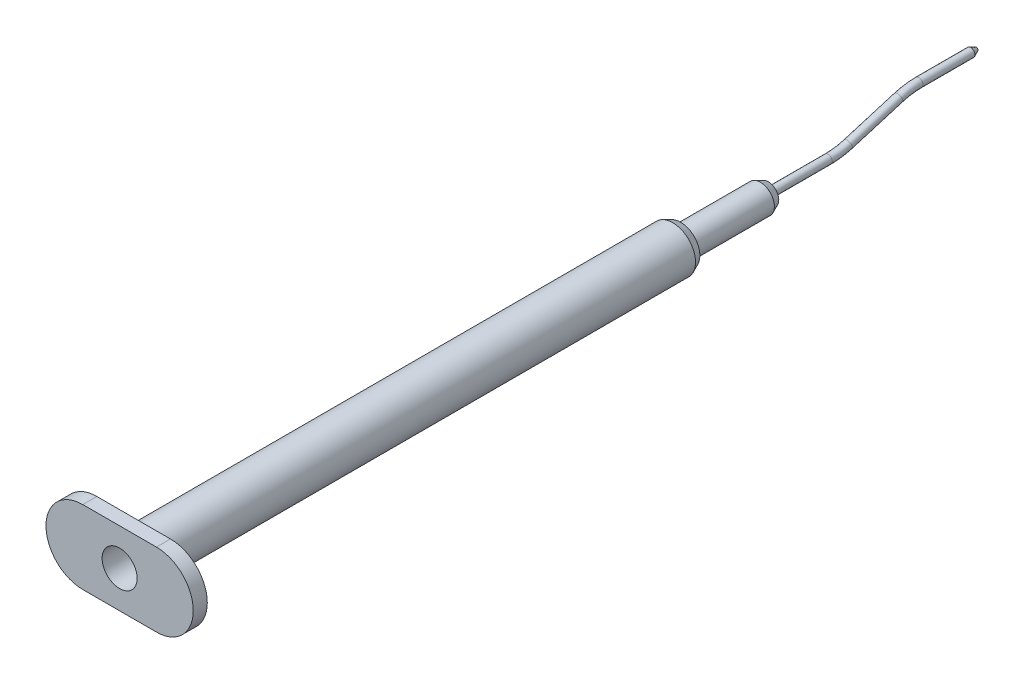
ISO-10303-21;
HEADER;
FILE_DESCRIPTION(('STEP AP214'),'2;1');
FILE_NAME('part.step','',(''),(''),'','','');
FILE_SCHEMA(('AUTOMOTIVE_DESIGN { 1 0 10303 214 1 1 1 1 }'));
ENDSEC;
DATA;
#1=APPLICATION_CONTEXT('core data for automotive mechanical design processes');
#2=APPLICATION_PROTOCOL_DEFINITION('international standard','automotive_design',2000,#1);
#3=PRODUCT_CONTEXT('',#1,'mechanical');
#4=PRODUCT('Part','Part','',(#3));
#5=PRODUCT_RELATED_PRODUCT_CATEGORY('part','',(#4));
#6=PRODUCT_DEFINITION_FORMATION('','',#4);
#7=PRODUCT_DEFINITION_CONTEXT('part definition',#1,'design');
#8=PRODUCT_DEFINITION('design','',#6,#7);
#9=PRODUCT_DEFINITION_SHAPE('','',#8);
#10=(LENGTH_UNIT() NAMED_UNIT(*) SI_UNIT(.MILLI.,.METRE.));
#11=(NAMED_UNIT(*) PLANE_ANGLE_UNIT() SI_UNIT($,.RADIAN.));
#12=(NAMED_UNIT(*) SI_UNIT($,.STERADIAN.) SOLID_ANGLE_UNIT());
#13=UNCERTAINTY_MEASURE_WITH_UNIT(LENGTH_MEASURE(1.E-05),#10,'distance_accuracy_value','');
#14=(GEOMETRIC_REPRESENTATION_CONTEXT(3) GLOBAL_UNCERTAINTY_ASSIGNED_CONTEXT((#13)) GLOBAL_UNIT_ASSIGNED_CONTEXT((#10,
#11,#12)) REPRESENTATION_CONTEXT('',''));
#15=CARTESIAN_POINT('',(0.,0.,0.));
#16=DIRECTION('',(0.,0.,1.));
#17=DIRECTION('',(1.,0.,0.));
#18=AXIS2_PLACEMENT_3D('',#15,#16,#17);
#19=CARTESIAN_POINT('',(0.,0.0360270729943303,-99.0323116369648));
#20=DIRECTION('',(0.,0.,1.));
#21=DIRECTION('',(1.,0.,0.));
#22=AXIS2_PLACEMENT_3D('',#19,#20,#21);
#23=CYLINDRICAL_SURFACE('',#22,0.6);
#24=CARTESIAN_POINT('',(0.,0.0360270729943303,-99.0323116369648));
#25=DIRECTION('',(0.,0.,1.));
#26=DIRECTION('',(1.,0.,0.));
#27=AXIS2_PLACEMENT_3D('',#24,#25,#26);
#28=CIRCLE('',#27,0.6);
#29=CARTESIAN_POINT('',(0.,-0.563972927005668,-99.0323116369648));
#30=VERTEX_POINT('',#29);
#31=EDGE_CURVE('E63',#30,#30,#28,.T.);
#32=ORIENTED_EDGE('',*,*,#31,.T.);
#33=EDGE_LOOP('',(#32));
#34=FACE_BOUND('',#33,.T.);
#35=CARTESIAN_POINT('',(1.04744440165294E-13,0.036027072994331,-90.5));
#36=DIRECTION('',(0.,0.,1.));
#37=DIRECTION('',(1.,0.,0.));
#38=AXIS2_PLACEMENT_3D('',#35,#36,#37);
#39=CIRCLE('',#38,0.6);
#40=CARTESIAN_POINT('',(0.600000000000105,0.036027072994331,-90.5));
#41=VERTEX_POINT('',#40);
#42=EDGE_CURVE('E54',#41,#41,#39,.T.);
#43=ORIENTED_EDGE('',*,*,#42,.F.);
#44=EDGE_LOOP('',(#43));
#45=FACE_BOUND('',#44,.T.);
#46=ADVANCED_FACE('F43',(#34,#45),#23,.T.);
#47=CARTESIAN_POINT('',(0.,0.0360270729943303,-99.0323116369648));
#48=DIRECTION('',(0.,0.,1.));
#49=DIRECTION('',(1.,0.,0.));
#50=AXIS2_PLACEMENT_3D('',#47,#48,#49);
#51=CYLINDRICAL_SURFACE('',#50,0.25);
#52=CARTESIAN_POINT('',(0.,0.0360270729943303,-99.0323116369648));
#53=DIRECTION('',(0.,0.,1.));
#54=DIRECTION('',(1.,0.,0.));
#55=AXIS2_PLACEMENT_3D('',#52,#53,#54);
#56=CIRCLE('',#55,0.25);
#57=CARTESIAN_POINT('',(0.,-0.213972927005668,-99.0323116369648));
#58=VERTEX_POINT('',#57);
#59=EDGE_CURVE('E66',#58,#58,#56,.T.);
#60=ORIENTED_EDGE('',*,*,#59,.F.);
#61=EDGE_LOOP('',(#60));
#62=FACE_BOUND('',#61,.T.);
#63=CARTESIAN_POINT('',(1.04744440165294E-13,0.036027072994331,-90.5));
#64=DIRECTION('',(0.,0.,1.));
#65=DIRECTION('',(1.,0.,0.));
#66=AXIS2_PLACEMENT_3D('',#63,#64,#65);
#67=CIRCLE('',#66,0.25);
#68=CARTESIAN_POINT('',(0.250000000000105,0.036027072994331,-90.5));
#69=VERTEX_POINT('',#68);
#70=EDGE_CURVE('E58',#69,#69,#67,.T.);
#71=ORIENTED_EDGE('',*,*,#70,.T.);
#72=EDGE_LOOP('',(#71));
#73=FACE_BOUND('',#72,.T.);
#74=ADVANCED_FACE('F111',(#62,#73),#51,.F.);
#75=CARTESIAN_POINT('',(0.,10.,-99.0323116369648));
#76=DIRECTION('',(-1.,0.,0.));
#77=DIRECTION('',(0.,0.,1.));
#78=AXIS2_PLACEMENT_3D('',#75,#76,#77);
#79=TOROIDAL_SURFACE('',#78,9.96397292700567,0.6);
#80=CARTESIAN_POINT('',(0.,0.45624482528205,-101.89543818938));
#81=DIRECTION('',(0.,-0.287347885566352,0.957826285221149));
#82=DIRECTION('',(1.,0.,0.));
#83=AXIS2_PLACEMENT_3D('',#80,#81,#82);
#84=CIRCLE('',#83,0.6);
#85=CARTESIAN_POINT('',(0.,-0.118450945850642,-102.06784692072));
#86=VERTEX_POINT('',#85);
#87=EDGE_CURVE('E69',#86,#86,#84,.T.);
#88=CARTESIAN_POINT('',(0.,10.,-99.0323116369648));
#89=DIRECTION('',(-1.,0.,0.));
#90=DIRECTION('',(0.,0.,1.));
#91=AXIS2_PLACEMENT_3D('',#88,#89,#90);
#92=CIRCLE('',#91,10.5639729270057);
#93=EDGE_CURVE('',#86,#30,#92,.T.);
#94=ORIENTED_EDGE('',*,*,#87,.T.);
#95=ORIENTED_EDGE('',*,*,#31,.F.);
#96=ORIENTED_EDGE('',*,*,#93,.T.);
#97=ORIENTED_EDGE('',*,*,#93,.F.);
#98=EDGE_LOOP('',(#94,#96,#95,#97));
#99=FACE_BOUND('',#98,.T.);
#100=ADVANCED_FACE('F107',(#99),#79,.T.);
#101=CARTESIAN_POINT('',(0.,10.,-99.0323116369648));
#102=DIRECTION('',(-1.,0.,0.));
#103=DIRECTION('',(0.,0.,1.));
#104=AXIS2_PLACEMENT_3D('',#101,#102,#103);
#105=TOROIDAL_SURFACE('',#104,9.96397292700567,0.25);
#106=CARTESIAN_POINT('',(0.,0.45624482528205,-101.89543818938));
#107=DIRECTION('',(0.,-0.287347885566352,0.957826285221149));
#108=DIRECTION('',(1.,0.,0.));
#109=AXIS2_PLACEMENT_3D('',#106,#107,#108);
#110=CIRCLE('',#109,0.25);
#111=CARTESIAN_POINT('',(0.,0.21678825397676,-101.967275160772));
#112=VERTEX_POINT('',#111);
#113=EDGE_CURVE('E72',#112,#112,#110,.T.);
#114=CARTESIAN_POINT('',(0.,10.,-99.0323116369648));
#115=DIRECTION('',(-1.,0.,0.));
#116=DIRECTION('',(0.,0.,1.));
#117=AXIS2_PLACEMENT_3D('',#114,#115,#116);
#118=CIRCLE('',#117,10.2139729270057);
#119=EDGE_CURVE('',#112,#58,#118,.T.);
#120=ORIENTED_EDGE('',*,*,#113,.F.);
#121=ORIENTED_EDGE('',*,*,#59,.T.);
#122=ORIENTED_EDGE('',*,*,#119,.T.);
#123=ORIENTED_EDGE('',*,*,#119,.F.);
#124=EDGE_LOOP('',(#120,#122,#121,#123));
#125=FACE_BOUND('',#124,.T.);
#126=ADVANCED_FACE('F104',(#125),#105,.F.);
#127=CARTESIAN_POINT('',(0.,2.61277052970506,-109.083857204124));
#128=DIRECTION('',(0.,-0.287347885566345,0.957826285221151));
#129=DIRECTION('',(0.,-0.957826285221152,-0.287347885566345));
#130=AXIS2_PLACEMENT_3D('',#127,#128,#129);
#131=CYLINDRICAL_SURFACE('',#130,0.6);
#132=CARTESIAN_POINT('',(0.,2.61277052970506,-109.083857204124));
#133=DIRECTION('',(0.,-0.287347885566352,0.957826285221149));
#134=DIRECTION('',(1.,0.,0.));
#135=AXIS2_PLACEMENT_3D('',#132,#133,#134);
#136=CIRCLE('',#135,0.6);
#137=CARTESIAN_POINT('',(0.,3.18746630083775,-108.911448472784));
#138=VERTEX_POINT('',#137);
#139=EDGE_CURVE('E75',#138,#138,#136,.T.);
#140=ORIENTED_EDGE('',*,*,#139,.T.);
#141=EDGE_LOOP('',(#140));
#142=FACE_BOUND('',#141,.T.);
#143=ORIENTED_EDGE('',*,*,#87,.F.);
#144=EDGE_LOOP('',(#143));
#145=FACE_BOUND('',#144,.T.);
#146=ADVANCED_FACE('F100',(#142,#145),#131,.T.);
#147=CARTESIAN_POINT('',(0.,2.61277052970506,-109.083857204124));
#148=DIRECTION('',(0.,-0.287347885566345,0.957826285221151));
#149=DIRECTION('',(0.,-0.957826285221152,-0.287347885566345));
#150=AXIS2_PLACEMENT_3D('',#147,#148,#149);
#151=CYLINDRICAL_SURFACE('',#150,0.25);
#152=CARTESIAN_POINT('',(0.,2.61277052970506,-109.083857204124));
#153=DIRECTION('',(0.,-0.287347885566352,0.957826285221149));
#154=DIRECTION('',(1.,0.,0.));
#155=AXIS2_PLACEMENT_3D('',#152,#153,#154);
#156=CIRCLE('',#155,0.25);
#157=CARTESIAN_POINT('',(0.,2.85222710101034,-109.012020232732));
#158=VERTEX_POINT('',#157);
#159=EDGE_CURVE('E78',#158,#158,#156,.T.);
#160=ORIENTED_EDGE('',*,*,#159,.F.);
#161=EDGE_LOOP('',(#160));
#162=FACE_BOUND('',#161,.T.);
#163=ORIENTED_EDGE('',*,*,#113,.T.);
#164=EDGE_LOOP('',(#163));
#165=FACE_BOUND('',#164,.T.);
#166=ADVANCED_FACE('F97',(#162,#165),#151,.F.);
#167=CARTESIAN_POINT('',(0.,-7.,-111.967688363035));
#168=DIRECTION('',(1.,0.,0.));
#169=DIRECTION('',(0.,0.,-1.));
#170=AXIS2_PLACEMENT_3D('',#167,#168,#169);
#171=TOROIDAL_SURFACE('',#170,10.0360270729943,0.6);
#172=CARTESIAN_POINT('',(0.,3.03602707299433,-111.967688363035));
#173=DIRECTION('',(0.,0.,1.));
#174=DIRECTION('',(1.,0.,0.));
#175=AXIS2_PLACEMENT_3D('',#172,#173,#174);
#176=CIRCLE('',#175,0.6);
#177=CARTESIAN_POINT('',(0.,3.63602707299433,-111.967688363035));
#178=VERTEX_POINT('',#177);
#179=EDGE_CURVE('E81',#178,#178,#176,.T.);
#180=CARTESIAN_POINT('',(0.,-7.,-111.967688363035));
#181=DIRECTION('',(1.,0.,0.));
#182=DIRECTION('',(0.,0.,-1.));
#183=AXIS2_PLACEMENT_3D('',#180,#181,#182);
#184=CIRCLE('',#183,10.6360270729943);
#185=EDGE_CURVE('',#178,#138,#184,.T.);
#186=ORIENTED_EDGE('',*,*,#179,.T.);
#187=ORIENTED_EDGE('',*,*,#139,.F.);
#188=ORIENTED_EDGE('',*,*,#185,.T.);
#189=ORIENTED_EDGE('',*,*,#185,.F.);
#190=EDGE_LOOP('',(#186,#188,#187,#189));
#191=FACE_BOUND('',#190,.T.);
#192=ADVANCED_FACE('F93',(#191),#171,.T.);
#193=CARTESIAN_POINT('',(0.,-7.,-111.967688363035));
#194=DIRECTION('',(1.,0.,0.));
#195=DIRECTION('',(0.,0.,-1.));
#196=AXIS2_PLACEMENT_3D('',#193,#194,#195);
#197=TOROIDAL_SURFACE('',#196,10.0360270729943,0.25);
#198=CARTESIAN_POINT('',(0.,3.03602707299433,-111.967688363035));
#199=DIRECTION('',(0.,0.,1.));
#200=DIRECTION('',(1.,0.,0.));
#201=AXIS2_PLACEMENT_3D('',#198,#199,#200);
#202=CIRCLE('',#201,0.25);
#203=CARTESIAN_POINT('',(0.,3.28602707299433,-111.967688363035));
#204=VERTEX_POINT('',#203);
#205=EDGE_CURVE('E84',#204,#204,#202,.T.);
#206=CARTESIAN_POINT('',(0.,-7.,-111.967688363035));
#207=DIRECTION('',(1.,0.,0.));
#208=DIRECTION('',(0.,0.,-1.));
#209=AXIS2_PLACEMENT_3D('',#206,#207,#208);
#210=CIRCLE('',#209,10.2860270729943);
#211=EDGE_CURVE('',#204,#158,#210,.T.);
#212=ORIENTED_EDGE('',*,*,#205,.F.);
#213=ORIENTED_EDGE('',*,*,#159,.T.);
#214=ORIENTED_EDGE('',*,*,#211,.T.);
#215=ORIENTED_EDGE('',*,*,#211,.F.);
#216=EDGE_LOOP('',(#212,#214,#213,#215));
#217=FACE_BOUND('',#216,.T.);
#218=ADVANCED_FACE('F90',(#217),#197,.F.);
#219=CARTESIAN_POINT('',(0.,3.03602707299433,-111.967688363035));
#220=DIRECTION('',(0.,0.,-1.));
#221=DIRECTION('',(-1.,0.,0.));
#222=AXIS2_PLACEMENT_3D('',#219,#220,#221);
#223=CYLINDRICAL_SURFACE('',#222,0.25);
#224=CARTESIAN_POINT('',(0.,3.03602707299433,-120.163094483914));
#225=DIRECTION('',(0.,0.,1.));
#226=DIRECTION('',(1.,0.,0.));
#227=AXIS2_PLACEMENT_3D('',#224,#225,#226);
#228=CIRCLE('',#227,0.25);
#229=CARTESIAN_POINT('',(0.250000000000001,3.03602707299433,-120.163094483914));
#230=VERTEX_POINT('',#229);
#231=EDGE_CURVE('E11',#230,#230,#228,.F.);
#232=ORIENTED_EDGE('',*,*,#231,.T.);
#233=EDGE_LOOP('',(#232));
#234=FACE_BOUND('',#233,.T.);
#235=ORIENTED_EDGE('',*,*,#205,.T.);
#236=EDGE_LOOP('',(#235));
#237=FACE_BOUND('',#236,.T.);
#238=ADVANCED_FACE('F88',(#234,#237),#223,.F.);
#239=CARTESIAN_POINT('',(0.,3.03602707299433,-111.967688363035));
#240=DIRECTION('',(0.,0.,-1.));
#241=DIRECTION('',(-1.,0.,0.));
#242=AXIS2_PLACEMENT_3D('',#239,#240,#241);
#243=CYLINDRICAL_SURFACE('',#242,0.6);
#244=CARTESIAN_POINT('',(0.,3.03602707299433,-119.376981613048));
#245=DIRECTION('',(0.,0.,1.));
#246=DIRECTION('',(1.,0.,0.));
#247=AXIS2_PLACEMENT_3D('',#244,#245,#246);
#248=CIRCLE('',#247,0.6);
#249=CARTESIAN_POINT('',(0.600000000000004,3.03602707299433,-119.376981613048));
#250=VERTEX_POINT('',#249);
#251=EDGE_CURVE('E50',#250,#250,#248,.T.);
#252=ORIENTED_EDGE('',*,*,#251,.T.);
#253=EDGE_LOOP('',(#252));
#254=FACE_BOUND('',#253,.T.);
#255=ORIENTED_EDGE('',*,*,#179,.F.);
#256=EDGE_LOOP('',(#255));
#257=FACE_BOUND('',#256,.T.);
#258=ADVANCED_FACE('F120',(#254,#257),#243,.T.);
#259=CARTESIAN_POINT('',(1.04744440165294E-13,0.036027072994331,-90.5));
#260=DIRECTION('',(0.,0.,1.));
#261=DIRECTION('',(1.,0.,0.));
#262=AXIS2_PLACEMENT_3D('',#259,#260,#261);
#263=PLANE('',#262);
#264=ORIENTED_EDGE('',*,*,#70,.F.);
#265=EDGE_LOOP('',(#264));
#266=FACE_BOUND('',#265,.T.);
#267=ORIENTED_EDGE('',*,*,#42,.T.);
#268=EDGE_LOOP('',(#267));
#269=FACE_BOUND('',#268,.T.);
#270=ADVANCED_FACE('F117',(#266,#269),#263,.T.);
#271=CARTESIAN_POINT('',(0.,3.03602707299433,-119.376981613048));
#272=DIRECTION('',(0.,0.,1.));
#273=DIRECTION('',(1.,0.,0.));
#274=AXIS2_PLACEMENT_3D('',#271,#272,#273);
#275=CONICAL_SURFACE('',#274,0.6,0.418879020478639);
#276=ORIENTED_EDGE('',*,*,#231,.F.);
#277=EDGE_LOOP('',(#276));
#278=FACE_BOUND('',#277,.T.);
#279=ORIENTED_EDGE('',*,*,#251,.F.);
#280=EDGE_LOOP('',(#279));
#281=FACE_BOUND('',#280,.T.);
#282=ADVANCED_FACE('F45',(#278,#281),#275,.T.);
#283=CLOSED_SHELL('',(#46,#74,#100,#126,#146,#166,#192,#218,#238,#258,#270,#282));
#284=MANIFOLD_SOLID_BREP('B2',#283);
#285=CARTESIAN_POINT('',(0.,0.,-75.));
#286=DIRECTION('',(0.,0.,1.));
#287=DIRECTION('',(1.,0.,0.));
#288=AXIS2_PLACEMENT_3D('',#285,#286,#287);
#289=CYLINDRICAL_SURFACE('',#288,3.25);
#290=CARTESIAN_POINT('',(0.,0.,-76.8769816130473));
#291=DIRECTION('',(0.,0.,-1.));
#292=DIRECTION('',(-1.,0.,0.));
#293=AXIS2_PLACEMENT_3D('',#290,#291,#292);
#294=CIRCLE('',#293,3.25);
#295=CARTESIAN_POINT('',(-3.25,0.,-76.8769816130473));
#296=VERTEX_POINT('',#295);
#297=EDGE_CURVE('E234',#296,#296,#294,.F.);
#298=ORIENTED_EDGE('',*,*,#297,.T.);
#299=EDGE_LOOP('',(#298));
#300=FACE_BOUND('',#299,.T.);
#301=CARTESIAN_POINT('',(0.,0.,0.));
#302=DIRECTION('',(0.,0.,1.));
#303=DIRECTION('',(1.,0.,0.));
#304=AXIS2_PLACEMENT_3D('',#301,#302,#303);
#305=CIRCLE('',#304,3.25);
#306=CARTESIAN_POINT('',(3.25,0.,0.));
#307=VERTEX_POINT('',#306);
#308=EDGE_CURVE('E306',#307,#307,#305,.T.);
#309=ORIENTED_EDGE('',*,*,#308,.F.);
#310=EDGE_LOOP('',(#309));
#311=FACE_BOUND('',#310,.T.);
#312=ADVANCED_FACE('F225',(#300,#311),#289,.T.);
#313=CARTESIAN_POINT('',(0.,0.,-75.));
#314=DIRECTION('',(0.,0.,1.));
#315=DIRECTION('',(1.,0.,0.));
#316=AXIS2_PLACEMENT_3D('',#313,#314,#315);
#317=CYLINDRICAL_SURFACE('',#316,2.5);
#318=CARTESIAN_POINT('',(0.,0.,2.));
#319=DIRECTION('',(0.,0.,1.));
#320=DIRECTION('',(1.,0.,0.));
#321=AXIS2_PLACEMENT_3D('',#318,#319,#320);
#322=CIRCLE('',#321,2.5);
#323=CARTESIAN_POINT('',(2.5,0.,2.));
#324=VERTEX_POINT('',#323);
#325=EDGE_CURVE('E296',#324,#324,#322,.T.);
#326=ORIENTED_EDGE('',*,*,#325,.T.);
#327=EDGE_LOOP('',(#326));
#328=FACE_BOUND('',#327,.T.);
#329=CARTESIAN_POINT('',(0.,0.,-75.));
#330=DIRECTION('',(0.,0.,1.));
#331=DIRECTION('',(1.,0.,0.));
#332=AXIS2_PLACEMENT_3D('',#329,#330,#331);
#333=CIRCLE('',#332,2.5);
#334=CARTESIAN_POINT('',(2.5,0.,-75.));
#335=VERTEX_POINT('',#334);
#336=EDGE_CURVE('E303',#335,#335,#333,.T.);
#337=ORIENTED_EDGE('',*,*,#336,.F.);
#338=EDGE_LOOP('',(#337));
#339=FACE_BOUND('',#338,.T.);
#340=ADVANCED_FACE('F329',(#328,#339),#317,.F.);
#341=CARTESIAN_POINT('',(-5.25,0.,2.));
#342=DIRECTION('',(0.,0.,-1.));
#343=DIRECTION('',(-1.,0.,0.));
#344=AXIS2_PLACEMENT_3D('',#341,#342,#343);
#345=CYLINDRICAL_SURFACE('',#344,5.25);
#346=CARTESIAN_POINT('',(-5.25,0.,0.));
#347=DIRECTION('',(0.,0.,1.));
#348=DIRECTION('',(1.,0.,0.));
#349=AXIS2_PLACEMENT_3D('',#346,#347,#348);
#350=CIRCLE('',#349,5.25);
#351=CARTESIAN_POINT('',(-5.25,5.25,0.));
#352=VERTEX_POINT('',#351);
#353=CARTESIAN_POINT('',(-5.25,-5.25,0.));
#354=VERTEX_POINT('',#353);
#355=EDGE_CURVE('E293',#352,#354,#350,.T.);
#356=ORIENTED_EDGE('',*,*,#355,.T.);
#357=DIRECTION('',(0.,0.,-1.));
#358=VECTOR('',#357,1.);
#359=CARTESIAN_POINT('',(-5.25,-5.25,2.));
#360=LINE('',#359,#358);
#361=CARTESIAN_POINT('',(-5.25,-5.25,2.));
#362=VERTEX_POINT('',#361);
#363=EDGE_CURVE('E284',#362,#354,#360,.T.);
#364=ORIENTED_EDGE('',*,*,#363,.F.);
#365=CARTESIAN_POINT('',(-5.25,0.,2.));
#366=DIRECTION('',(0.,0.,1.));
#367=DIRECTION('',(1.,0.,0.));
#368=AXIS2_PLACEMENT_3D('',#365,#366,#367);
#369=CIRCLE('',#368,5.25);
#370=CARTESIAN_POINT('',(-5.25,5.25,2.));
#371=VERTEX_POINT('',#370);
#372=EDGE_CURVE('E278',#371,#362,#369,.T.);
#373=ORIENTED_EDGE('',*,*,#372,.F.);
#374=DIRECTION('',(0.,0.,-1.));
#375=VECTOR('',#374,1.);
#376=CARTESIAN_POINT('',(-5.25,5.25,2.));
#377=LINE('',#376,#375);
#378=EDGE_CURVE('E289',#371,#352,#377,.T.);
#379=ORIENTED_EDGE('',*,*,#378,.T.);
#380=EDGE_LOOP('',(#356,#364,#373,#379));
#381=FACE_BOUND('',#380,.T.);
#382=ADVANCED_FACE('F334',(#381),#345,.T.);
#383=CARTESIAN_POINT('',(-5.25,-5.25,2.));
#384=DIRECTION('',(0.,1.,0.));
#385=DIRECTION('',(0.,0.,1.));
#386=AXIS2_PLACEMENT_3D('',#383,#384,#385);
#387=PLANE('',#386);
#388=DIRECTION('',(1.,0.,0.));
#389=VECTOR('',#388,1.);
#390=CARTESIAN_POINT('',(-5.25,-5.25,0.));
#391=LINE('',#390,#389);
#392=CARTESIAN_POINT('',(5.25,-5.25,0.));
#393=VERTEX_POINT('',#392);
#394=EDGE_CURVE('E283',#354,#393,#391,.T.);
#395=ORIENTED_EDGE('',*,*,#394,.T.);
#396=DIRECTION('',(0.,0.,-1.));
#397=VECTOR('',#396,1.);
#398=CARTESIAN_POINT('',(5.25,-5.25,2.));
#399=LINE('',#398,#397);
#400=CARTESIAN_POINT('',(5.25,-5.25,2.));
#401=VERTEX_POINT('',#400);
#402=EDGE_CURVE('E281',#401,#393,#399,.T.);
#403=ORIENTED_EDGE('',*,*,#402,.F.);
#404=DIRECTION('',(1.,0.,0.));
#405=VECTOR('',#404,1.);
#406=CARTESIAN_POINT('',(-5.25,-5.25,2.));
#407=LINE('',#406,#405);
#408=EDGE_CURVE('E273',#362,#401,#407,.T.);
#409=ORIENTED_EDGE('',*,*,#408,.F.);
#410=ORIENTED_EDGE('',*,*,#363,.T.);
#411=EDGE_LOOP('',(#395,#403,#409,#410));
#412=FACE_BOUND('',#411,.T.);
#413=ADVANCED_FACE('F282',(#412),#387,.F.);
#414=CARTESIAN_POINT('',(5.25,0.,2.));
#415=DIRECTION('',(0.,0.,-1.));
#416=DIRECTION('',(-1.,0.,0.));
#417=AXIS2_PLACEMENT_3D('',#414,#415,#416);
#418=CYLINDRICAL_SURFACE('',#417,5.25);
#419=CARTESIAN_POINT('',(5.25,0.,0.));
#420=DIRECTION('',(0.,0.,1.));
#421=DIRECTION('',(1.,0.,0.));
#422=AXIS2_PLACEMENT_3D('',#419,#420,#421);
#423=CIRCLE('',#422,5.25);
#424=CARTESIAN_POINT('',(5.25,5.25,0.));
#425=VERTEX_POINT('',#424);
#426=EDGE_CURVE('E259',#393,#425,#423,.T.);
#427=ORIENTED_EDGE('',*,*,#426,.T.);
#428=DIRECTION('',(0.,0.,-1.));
#429=VECTOR('',#428,1.);
#430=CARTESIAN_POINT('',(5.25,5.25,2.));
#431=LINE('',#430,#429);
#432=CARTESIAN_POINT('',(5.25,5.25,2.));
#433=VERTEX_POINT('',#432);
#434=EDGE_CURVE('E285',#433,#425,#431,.T.);
#435=ORIENTED_EDGE('',*,*,#434,.F.);
#436=CARTESIAN_POINT('',(5.25,0.,2.));
#437=DIRECTION('',(0.,0.,1.));
#438=DIRECTION('',(1.,0.,0.));
#439=AXIS2_PLACEMENT_3D('',#436,#437,#438);
#440=CIRCLE('',#439,5.25);
#441=EDGE_CURVE('E276',#401,#433,#440,.T.);
#442=ORIENTED_EDGE('',*,*,#441,.F.);
#443=ORIENTED_EDGE('',*,*,#402,.T.);
#444=EDGE_LOOP('',(#427,#435,#442,#443));
#445=FACE_BOUND('',#444,.T.);
#446=ADVANCED_FACE('F287',(#445),#418,.T.);
#447=CARTESIAN_POINT('',(-5.25,5.25,2.));
#448=DIRECTION('',(0.,-1.,0.));
#449=DIRECTION('',(0.,0.,-1.));
#450=AXIS2_PLACEMENT_3D('',#447,#448,#449);
#451=PLANE('',#450);
#452=DIRECTION('',(-1.,0.,0.));
#453=VECTOR('',#452,1.);
#454=CARTESIAN_POINT('',(-5.25,5.25,0.));
#455=LINE('',#454,#453);
#456=EDGE_CURVE('E265',#425,#352,#455,.T.);
#457=ORIENTED_EDGE('',*,*,#456,.T.);
#458=ORIENTED_EDGE('',*,*,#378,.F.);
#459=DIRECTION('',(-1.,0.,0.));
#460=VECTOR('',#459,1.);
#461=CARTESIAN_POINT('',(-5.25,5.25,2.));
#462=LINE('',#461,#460);
#463=EDGE_CURVE('E242',#433,#371,#462,.T.);
#464=ORIENTED_EDGE('',*,*,#463,.F.);
#465=ORIENTED_EDGE('',*,*,#434,.T.);
#466=EDGE_LOOP('',(#457,#458,#464,#465));
#467=FACE_BOUND('',#466,.T.);
#468=ADVANCED_FACE('F345',(#467),#451,.F.);
#469=CARTESIAN_POINT('',(-5.25,0.,2.));
#470=DIRECTION('',(0.,0.,1.));
#471=DIRECTION('',(1.,0.,0.));
#472=AXIS2_PLACEMENT_3D('',#469,#470,#471);
#473=PLANE('',#472);
#474=ORIENTED_EDGE('',*,*,#325,.F.);
#475=EDGE_LOOP('',(#474));
#476=FACE_BOUND('',#475,.T.);
#477=ORIENTED_EDGE('',*,*,#372,.T.);
#478=ORIENTED_EDGE('',*,*,#408,.T.);
#479=ORIENTED_EDGE('',*,*,#441,.T.);
#480=ORIENTED_EDGE('',*,*,#463,.T.);
#481=EDGE_LOOP('',(#477,#478,#479,#480));
#482=FACE_BOUND('',#481,.T.);
#483=ADVANCED_FACE('F274',(#476,#482),#473,.T.);
#484=CARTESIAN_POINT('',(-5.25,0.,0.));
#485=DIRECTION('',(0.,0.,1.));
#486=DIRECTION('',(1.,0.,0.));
#487=AXIS2_PLACEMENT_3D('',#484,#485,#486);
#488=PLANE('',#487);
#489=ORIENTED_EDGE('',*,*,#308,.T.);
#490=EDGE_LOOP('',(#489));
#491=FACE_BOUND('',#490,.T.);
#492=ORIENTED_EDGE('',*,*,#355,.F.);
#493=ORIENTED_EDGE('',*,*,#456,.F.);
#494=ORIENTED_EDGE('',*,*,#426,.F.);
#495=ORIENTED_EDGE('',*,*,#394,.F.);
#496=EDGE_LOOP('',(#492,#493,#494,#495));
#497=FACE_BOUND('',#496,.T.);
#498=ADVANCED_FACE('F348',(#491,#497),#488,.F.);
#499=CARTESIAN_POINT('',(-2.61861100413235E-13,0.,-75.));
#500=DIRECTION('',(0.,0.,1.));
#501=DIRECTION('',(1.,0.,0.));
#502=AXIS2_PLACEMENT_3D('',#499,#500,#501);
#503=PLANE('',#502);
#504=CARTESIAN_POINT('',(-2.61861100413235E-13,0.,-75.));
#505=DIRECTION('',(0.,0.,1.));
#506=DIRECTION('',(1.,0.,0.));
#507=AXIS2_PLACEMENT_3D('',#504,#505,#506);
#508=CIRCLE('',#507,1.);
#509=CARTESIAN_POINT('',(-1.00000000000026,0.,-75.));
#510=VERTEX_POINT('',#509);
#511=EDGE_CURVE('E378',#510,#510,#508,.T.);
#512=ORIENTED_EDGE('',*,*,#511,.F.);
#513=EDGE_LOOP('',(#512));
#514=FACE_BOUND('',#513,.T.);
#515=ORIENTED_EDGE('',*,*,#336,.T.);
#516=EDGE_LOOP('',(#515));
#517=FACE_BOUND('',#516,.T.);
#518=ADVANCED_FACE('F351',(#514,#517),#503,.T.);
#519=CARTESIAN_POINT('',(-2.72335544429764E-13,-3.25,-78.));
#520=DIRECTION('',(0.,0.,-1.));
#521=DIRECTION('',(-1.,0.,0.));
#522=AXIS2_PLACEMENT_3D('',#519,#520,#521);
#523=PLANE('',#522);
#524=CARTESIAN_POINT('',(0.,0.,-78.));
#525=DIRECTION('',(0.,0.,-1.));
#526=DIRECTION('',(-1.,0.,0.));
#527=AXIS2_PLACEMENT_3D('',#524,#525,#526);
#528=CIRCLE('',#527,2.74999999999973);
#529=CARTESIAN_POINT('',(-2.74999999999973,0.,-78.));
#530=VERTEX_POINT('',#529);
#531=EDGE_CURVE('E41',#530,#530,#528,.T.);
#532=ORIENTED_EDGE('',*,*,#531,.T.);
#533=EDGE_LOOP('',(#532));
#534=FACE_BOUND('',#533,.T.);
#535=CARTESIAN_POINT('',(-2.72335544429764E-13,0.,-78.));
#536=DIRECTION('',(0.,0.,1.));
#537=DIRECTION('',(1.,0.,0.));
#538=AXIS2_PLACEMENT_3D('',#535,#536,#537);
#539=CIRCLE('',#538,2.);
#540=CARTESIAN_POINT('',(1.99999999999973,0.,-78.));
#541=VERTEX_POINT('',#540);
#542=EDGE_CURVE('E384',#541,#541,#539,.T.);
#543=ORIENTED_EDGE('',*,*,#542,.T.);
#544=EDGE_LOOP('',(#543));
#545=FACE_BOUND('',#544,.T.);
#546=ADVANCED_FACE('F358',(#534,#545),#523,.T.);
#547=CARTESIAN_POINT('',(0.,0.,2.00000000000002));
#548=DIRECTION('',(0.,0.,1.));
#549=DIRECTION('',(1.,0.,0.));
#550=AXIS2_PLACEMENT_3D('',#547,#548,#549);
#551=CYLINDRICAL_SURFACE('',#550,2.);
#552=CARTESIAN_POINT('',(-3.12058063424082E-13,0.,-89.3769816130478));
#553=DIRECTION('',(0.,0.,-1.));
#554=DIRECTION('',(-1.,0.,0.));
#555=AXIS2_PLACEMENT_3D('',#552,#553,#554);
#556=CIRCLE('',#555,2.);
#557=CARTESIAN_POINT('',(1.99999999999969,0.,-89.3769816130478));
#558=VERTEX_POINT('',#557);
#559=EDGE_CURVE('E309',#558,#558,#556,.F.);
#560=ORIENTED_EDGE('',*,*,#559,.T.);
#561=EDGE_LOOP('',(#560));
#562=FACE_BOUND('',#561,.T.);
#563=ORIENTED_EDGE('',*,*,#542,.F.);
#564=EDGE_LOOP('',(#563));
#565=FACE_BOUND('',#564,.T.);
#566=ADVANCED_FACE('F362',(#562,#565),#551,.T.);
#567=CARTESIAN_POINT('',(-3.15979061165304E-13,-2.,-90.5));
#568=DIRECTION('',(0.,0.,-1.));
#569=DIRECTION('',(-1.,0.,0.));
#570=AXIS2_PLACEMENT_3D('',#567,#568,#569);
#571=PLANE('',#570);
#572=CARTESIAN_POINT('',(-3.15979061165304E-13,0.,-90.5));
#573=DIRECTION('',(0.,0.,-1.));
#574=DIRECTION('',(-1.,0.,0.));
#575=AXIS2_PLACEMENT_3D('',#572,#573,#574);
#576=CIRCLE('',#575,1.49999999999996);
#577=CARTESIAN_POINT('',(1.49999999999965,0.,-90.5));
#578=VERTEX_POINT('',#577);
#579=EDGE_CURVE('E312',#578,#578,#576,.T.);
#580=ORIENTED_EDGE('',*,*,#579,.T.);
#581=EDGE_LOOP('',(#580));
#582=FACE_BOUND('',#581,.T.);
#583=CARTESIAN_POINT('',(-3.15979061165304E-13,0.,-90.5));
#584=DIRECTION('',(0.,0.,-1.));
#585=DIRECTION('',(-1.,0.,0.));
#586=AXIS2_PLACEMENT_3D('',#583,#584,#585);
#587=CIRCLE('',#586,1.);
#588=CARTESIAN_POINT('',(-1.00000000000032,0.,-90.5));
#589=VERTEX_POINT('',#588);
#590=EDGE_CURVE('E381',#589,#589,#587,.T.);
#591=ORIENTED_EDGE('',*,*,#590,.F.);
#592=EDGE_LOOP('',(#591));
#593=FACE_BOUND('',#592,.T.);
#594=ADVANCED_FACE('F366',(#582,#593),#571,.T.);
#595=CARTESIAN_POINT('',(0.,0.,2.00000000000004));
#596=DIRECTION('',(0.,0.,-1.));
#597=DIRECTION('',(-1.,0.,0.));
#598=AXIS2_PLACEMENT_3D('',#595,#596,#597);
#599=CYLINDRICAL_SURFACE('',#598,1.);
#600=CARTESIAN_POINT('',(-1.00000000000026,0.,-75.));
#601=CARTESIAN_POINT('',(-1.00000000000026,0.,-75.1614583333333));
#602=CARTESIAN_POINT('',(-1.00000000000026,0.,-75.3229166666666));
#603=CARTESIAN_POINT('',(-1.00000000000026,0.,-75.6458333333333));
#604=CARTESIAN_POINT('',(-1.00000000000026,0.,-75.8072916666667));
#605=CARTESIAN_POINT('',(-1.00000000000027,0.,-76.1302083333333));
#606=CARTESIAN_POINT('',(-1.00000000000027,0.,-76.2916666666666));
#607=CARTESIAN_POINT('',(-1.00000000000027,0.,-76.6145833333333));
#608=CARTESIAN_POINT('',(-1.00000000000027,0.,-76.7760416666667));
#609=CARTESIAN_POINT('',(-1.00000000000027,0.,-77.0989583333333));
#610=CARTESIAN_POINT('',(-1.00000000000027,0.,-77.2604166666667));
#611=CARTESIAN_POINT('',(-1.00000000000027,0.,-77.5833333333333));
#612=CARTESIAN_POINT('',(-1.00000000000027,0.,-77.7447916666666));
#613=CARTESIAN_POINT('',(-1.00000000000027,0.,-78.0677083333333));
#614=CARTESIAN_POINT('',(-1.00000000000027,0.,-78.2291666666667));
#615=CARTESIAN_POINT('',(-1.00000000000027,0.,-78.5520833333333));
#616=CARTESIAN_POINT('',(-1.00000000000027,0.,-78.7135416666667));
#617=CARTESIAN_POINT('',(-1.00000000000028,0.,-79.0364583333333));
#618=CARTESIAN_POINT('',(-1.00000000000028,0.,-79.1979166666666));
#619=CARTESIAN_POINT('',(-1.00000000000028,0.,-79.5208333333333));
#620=CARTESIAN_POINT('',(-1.00000000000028,0.,-79.6822916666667));
#621=CARTESIAN_POINT('',(-1.00000000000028,0.,-80.0052083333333));
#622=CARTESIAN_POINT('',(-1.00000000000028,0.,-80.1666666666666));
#623=CARTESIAN_POINT('',(-1.00000000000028,0.,-80.4895833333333));
#624=CARTESIAN_POINT('',(-1.00000000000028,0.,-80.6510416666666));
#625=CARTESIAN_POINT('',(-1.00000000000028,0.,-80.9739583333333));
#626=CARTESIAN_POINT('',(-1.00000000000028,0.,-81.1354166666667));
#627=CARTESIAN_POINT('',(-1.00000000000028,0.,-81.4583333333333));
#628=CARTESIAN_POINT('',(-1.00000000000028,0.,-81.6197916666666));
#629=CARTESIAN_POINT('',(-1.00000000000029,0.,-81.9427083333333));
#630=CARTESIAN_POINT('',(-1.00000000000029,0.,-82.1041666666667));
#631=CARTESIAN_POINT('',(-1.00000000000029,0.,-82.4270833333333));
#632=CARTESIAN_POINT('',(-1.00000000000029,0.,-82.5885416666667));
#633=CARTESIAN_POINT('',(-1.00000000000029,0.,-82.9114583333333));
#634=CARTESIAN_POINT('',(-1.00000000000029,0.,-83.0729166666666));
#635=CARTESIAN_POINT('',(-1.00000000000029,0.,-83.3958333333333));
#636=CARTESIAN_POINT('',(-1.00000000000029,0.,-83.5572916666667));
#637=CARTESIAN_POINT('',(-1.00000000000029,0.,-83.8802083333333));
#638=CARTESIAN_POINT('',(-1.00000000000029,0.,-84.0416666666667));
#639=CARTESIAN_POINT('',(-1.00000000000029,0.,-84.3645833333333));
#640=CARTESIAN_POINT('',(-1.0000000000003,0.,-84.5260416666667));
#641=CARTESIAN_POINT('',(-1.0000000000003,0.,-84.8489583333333));
#642=CARTESIAN_POINT('',(-1.0000000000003,0.,-85.0104166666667));
#643=CARTESIAN_POINT('',(-1.0000000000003,0.,-85.3333333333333));
#644=CARTESIAN_POINT('',(-1.0000000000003,0.,-85.4947916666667));
#645=CARTESIAN_POINT('',(-1.0000000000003,0.,-85.8177083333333));
#646=CARTESIAN_POINT('',(-1.0000000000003,0.,-85.9791666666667));
#647=CARTESIAN_POINT('',(-1.0000000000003,0.,-86.3020833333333));
#648=CARTESIAN_POINT('',(-1.0000000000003,0.,-86.4635416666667));
#649=CARTESIAN_POINT('',(-1.0000000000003,0.,-86.7864583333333));
#650=CARTESIAN_POINT('',(-1.0000000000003,0.,-86.9479166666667));
#651=CARTESIAN_POINT('',(-1.0000000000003,0.,-87.2708333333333));
#652=CARTESIAN_POINT('',(-1.00000000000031,0.,-87.4322916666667));
#653=CARTESIAN_POINT('',(-1.00000000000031,0.,-87.7552083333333));
#654=CARTESIAN_POINT('',(-1.00000000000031,0.,-87.9166666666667));
#655=CARTESIAN_POINT('',(-1.00000000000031,0.,-88.2395833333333));
#656=CARTESIAN_POINT('',(-1.00000000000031,0.,-88.4010416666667));
#657=CARTESIAN_POINT('',(-1.00000000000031,0.,-88.7239583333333));
#658=CARTESIAN_POINT('',(-1.00000000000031,0.,-88.8854166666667));
#659=CARTESIAN_POINT('',(-1.00000000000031,0.,-89.2083333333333));
#660=CARTESIAN_POINT('',(-1.00000000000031,0.,-89.3697916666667));
#661=CARTESIAN_POINT('',(-1.00000000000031,0.,-89.6927083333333));
#662=CARTESIAN_POINT('',(-1.00000000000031,0.,-89.8541666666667));
#663=CARTESIAN_POINT('',(-1.00000000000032,0.,-90.1770833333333));
#664=CARTESIAN_POINT('',(-1.00000000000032,0.,-90.3385416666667));
#665=CARTESIAN_POINT('',(-1.00000000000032,0.,-90.5));
#666=B_SPLINE_CURVE_WITH_KNOTS('',3,(#600,#601,#602,#603,#604,#605,#606,#607,#608,#609,#610,
#611,#612,#613,#614,#615,#616,#617,#618,#619,#620,#621,#622,#623,#624,#625,#626,#627,#628,#629,
#630,#631,#632,#633,#634,#635,#636,#637,#638,#639,#640,#641,#642,#643,#644,#645,#646,#647,#648,
#649,#650,#651,#652,#653,#654,#655,#656,#657,#658,#659,#660,#661,#662,#663,#664,#665),
.UNSPECIFIED.,.F.,.F.,(4,2,2,2,2,2,2,2,2,2,2,2,2,2,2,2,2,2,2,2,2,2,2,2,2,2,2,2,2,2,2,2,4),(0.,
0.484374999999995,0.968750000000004,1.453125,1.93750000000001,2.421875,2.90625,3.39062500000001,
3.875,4.359375,4.84375000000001,5.328125,5.8125,6.29687500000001,6.78125,7.26562500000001,
7.75000000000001,8.234375,8.71875000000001,9.20312500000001,9.68750000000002,10.171875,10.65625,
11.140625,11.625,12.109375,12.59375,13.078125,13.5625,14.046875,14.53125,15.015625,15.5),.UNSPECIFIED.);
#667=EDGE_CURVE('BSEAM325',#510,#589,#666,.T.);
#668=ORIENTED_EDGE('',*,*,#511,.T.);
#669=ORIENTED_EDGE('',*,*,#590,.T.);
#670=ORIENTED_EDGE('',*,*,#667,.T.);
#671=ORIENTED_EDGE('',*,*,#667,.F.);
#672=EDGE_LOOP('',(#668,#670,#669,#671));
#673=FACE_BOUND('',#672,.T.);
#674=ADVANCED_FACE('F325',(#673),#599,.F.);
#675=CARTESIAN_POINT('',(-3.12058063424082E-13,0.,-89.3769816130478));
#676=DIRECTION('',(0.,0.,1.));
#677=DIRECTION('',(1.,0.,0.));
#678=AXIS2_PLACEMENT_3D('',#675,#676,#677);
#679=CONICAL_SURFACE('',#678,2.,0.418879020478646);
#680=CARTESIAN_POINT('',(1.49999999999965,0.,-90.5));
#681=CARTESIAN_POINT('',(1.50520833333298,0.,-90.4883018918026));
#682=CARTESIAN_POINT('',(1.51041666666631,0.,-90.4766037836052));
#683=CARTESIAN_POINT('',(1.52083333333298,0.,-90.4532075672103));
#684=CARTESIAN_POINT('',(1.52604166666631,0.,-90.4415094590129));
#685=CARTESIAN_POINT('',(1.53645833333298,0.,-90.4181132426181));
#686=CARTESIAN_POINT('',(1.54166666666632,0.,-90.4064151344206));
#687=CARTESIAN_POINT('',(1.55208333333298,0.,-90.3830189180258));
#688=CARTESIAN_POINT('',(1.55729166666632,0.,-90.3713208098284));
#689=CARTESIAN_POINT('',(1.56770833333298,0.,-90.3479245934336));
#690=CARTESIAN_POINT('',(1.57291666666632,0.,-90.3362264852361));
#691=CARTESIAN_POINT('',(1.58333333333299,0.,-90.3128302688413));
#692=CARTESIAN_POINT('',(1.58854166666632,0.,-90.3011321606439));
#693=CARTESIAN_POINT('',(1.59895833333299,0.,-90.277735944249));
#694=CARTESIAN_POINT('',(1.60416666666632,0.,-90.2660378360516));
#695=CARTESIAN_POINT('',(1.61458333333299,0.,-90.2426416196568));
#696=CARTESIAN_POINT('',(1.61979166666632,0.,-90.2309435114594));
#697=CARTESIAN_POINT('',(1.63020833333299,0.,-90.2075472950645));
#698=CARTESIAN_POINT('',(1.63541666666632,0.,-90.1958491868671));
#699=CARTESIAN_POINT('',(1.64583333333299,0.,-90.1724529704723));
#700=CARTESIAN_POINT('',(1.65104166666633,0.,-90.1607548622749));
#701=CARTESIAN_POINT('',(1.66145833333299,0.,-90.13735864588));
#702=CARTESIAN_POINT('',(1.66666666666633,0.,-90.1256605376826));
#703=CARTESIAN_POINT('',(1.677083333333,0.,-90.1022643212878));
#704=CARTESIAN_POINT('',(1.68229166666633,0.,-90.0905662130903));
#705=CARTESIAN_POINT('',(1.692708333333,0.,-90.0671699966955));
#706=CARTESIAN_POINT('',(1.69791666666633,0.,-90.0554718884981));
#707=CARTESIAN_POINT('',(1.708333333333,0.,-90.0320756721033));
#708=CARTESIAN_POINT('',(1.71354166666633,0.,-90.0203775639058));
#709=CARTESIAN_POINT('',(1.723958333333,0.,-89.996981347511));
#710=CARTESIAN_POINT('',(1.72916666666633,0.,-89.9852832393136));
#711=CARTESIAN_POINT('',(1.739583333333,0.,-89.9618870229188));
#712=CARTESIAN_POINT('',(1.74479166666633,0.,-89.9501889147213));
#713=CARTESIAN_POINT('',(1.755208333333,0.,-89.9267926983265));
#714=CARTESIAN_POINT('',(1.76041666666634,0.,-89.9150945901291));
#715=CARTESIAN_POINT('',(1.770833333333,0.,-89.8916983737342));
#716=CARTESIAN_POINT('',(1.77604166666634,0.,-89.8800002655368));
#717=CARTESIAN_POINT('',(1.78645833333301,0.,-89.856604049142));
#718=CARTESIAN_POINT('',(1.79166666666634,0.,-89.8449059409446));
#719=CARTESIAN_POINT('',(1.80208333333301,0.,-89.8215097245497));
#720=CARTESIAN_POINT('',(1.80729166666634,0.,-89.8098116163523));
#721=CARTESIAN_POINT('',(1.81770833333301,0.,-89.7864153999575));
#722=CARTESIAN_POINT('',(1.82291666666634,0.,-89.7747172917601));
#723=CARTESIAN_POINT('',(1.83333333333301,0.,-89.7513210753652));
#724=CARTESIAN_POINT('',(1.83854166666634,0.,-89.7396229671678));
#725=CARTESIAN_POINT('',(1.84895833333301,0.,-89.716226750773));
#726=CARTESIAN_POINT('',(1.85416666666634,0.,-89.7045286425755));
#727=CARTESIAN_POINT('',(1.86458333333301,0.,-89.6811324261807));
#728=CARTESIAN_POINT('',(1.86979166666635,0.,-89.6694343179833));
#729=CARTESIAN_POINT('',(1.88020833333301,0.,-89.6460381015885));
#730=CARTESIAN_POINT('',(1.88541666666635,0.,-89.634339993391));
#731=CARTESIAN_POINT('',(1.89583333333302,0.,-89.6109437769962));
#732=CARTESIAN_POINT('',(1.90104166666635,0.,-89.5992456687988));
#733=CARTESIAN_POINT('',(1.91145833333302,0.,-89.5758494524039));
#734=CARTESIAN_POINT('',(1.91666666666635,0.,-89.5641513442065));
#735=CARTESIAN_POINT('',(1.92708333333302,0.,-89.5407551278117));
#736=CARTESIAN_POINT('',(1.93229166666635,0.,-89.5290570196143));
#737=CARTESIAN_POINT('',(1.94270833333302,0.,-89.5056608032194));
#738=CARTESIAN_POINT('',(1.94791666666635,0.,-89.493962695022));
#739=CARTESIAN_POINT('',(1.95833333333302,0.,-89.4705664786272));
#740=CARTESIAN_POINT('',(1.96354166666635,0.,-89.4588683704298));
#741=CARTESIAN_POINT('',(1.97395833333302,0.,-89.4354721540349));
#742=CARTESIAN_POINT('',(1.97916666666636,0.,-89.4237740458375));
#743=CARTESIAN_POINT('',(1.98958333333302,0.,-89.4003778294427));
#744=CARTESIAN_POINT('',(1.99479166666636,0.,-89.3886797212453));
#745=CARTESIAN_POINT('',(1.99999999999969,0.,-89.3769816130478));
#746=B_SPLINE_CURVE_WITH_KNOTS('',3,(#680,#681,#682,#683,#684,#685,#686,#687,#688,#689,#690,
#691,#692,#693,#694,#695,#696,#697,#698,#699,#700,#701,#702,#703,#704,#705,#706,#707,#708,#709,
#710,#711,#712,#713,#714,#715,#716,#717,#718,#719,#720,#721,#722,#723,#724,#725,#726,#727,#728,
#729,#730,#731,#732,#733,#734,#735,#736,#737,#738,#739,#740,#741,#742,#743,#744,#745),
.UNSPECIFIED.,.F.,.F.,(4,2,2,2,2,2,2,2,2,2,2,2,2,2,2,2,2,2,2,2,2,2,2,2,2,2,2,2,2,2,2,2,4),(0.,
0.0384155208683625,0.0768310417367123,0.115246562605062,0.153662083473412,0.192077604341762,
0.230493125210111,0.268908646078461,0.307324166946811,0.345739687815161,0.384155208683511,
0.42257072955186,0.46098625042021,0.49940177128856,0.53781729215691,0.57623281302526,
0.614648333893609,0.653063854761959,0.691479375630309,0.729894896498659,0.768310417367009,
0.806725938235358,0.845141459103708,0.883556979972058,0.921972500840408,0.960388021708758,
0.998803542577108,1.03721906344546,1.07563458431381,1.11405010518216,1.15246562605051,
1.19088114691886,1.22929666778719),.UNSPECIFIED.);
#747=EDGE_CURVE('BSEAM320',#578,#558,#746,.T.);
#748=ORIENTED_EDGE('',*,*,#579,.F.);
#749=ORIENTED_EDGE('',*,*,#559,.F.);
#750=ORIENTED_EDGE('',*,*,#747,.T.);
#751=ORIENTED_EDGE('',*,*,#747,.F.);
#752=EDGE_LOOP('',(#748,#750,#749,#751));
#753=FACE_BOUND('',#752,.T.);
#754=ADVANCED_FACE('F320',(#753),#679,.T.);
#755=CARTESIAN_POINT('',(0.,0.,-76.8769816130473));
#756=DIRECTION('',(0.,0.,1.));
#757=DIRECTION('',(1.,0.,0.));
#758=AXIS2_PLACEMENT_3D('',#755,#756,#757);
#759=CONICAL_SURFACE('',#758,3.25,0.418879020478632);
#760=ORIENTED_EDGE('',*,*,#531,.F.);
#761=EDGE_LOOP('',(#760));
#762=FACE_BOUND('',#761,.T.);
#763=ORIENTED_EDGE('',*,*,#297,.F.);
#764=EDGE_LOOP('',(#763));
#765=FACE_BOUND('',#764,.T.);
#766=ADVANCED_FACE('F227',(#762,#765),#759,.T.);
#767=CLOSED_SHELL('',(#312,#340,#382,#413,#446,#468,#483,#498,#518,#546,#566,#594,#674,#754,#766));
#768=MANIFOLD_SOLID_BREP('B6',#767);
#769=ADVANCED_BREP_SHAPE_REPRESENTATION('',(#18,#284,#768),#14);
#770=SHAPE_DEFINITION_REPRESENTATION(#9,#769);
ENDSEC;
END-ISO-10303-21;
